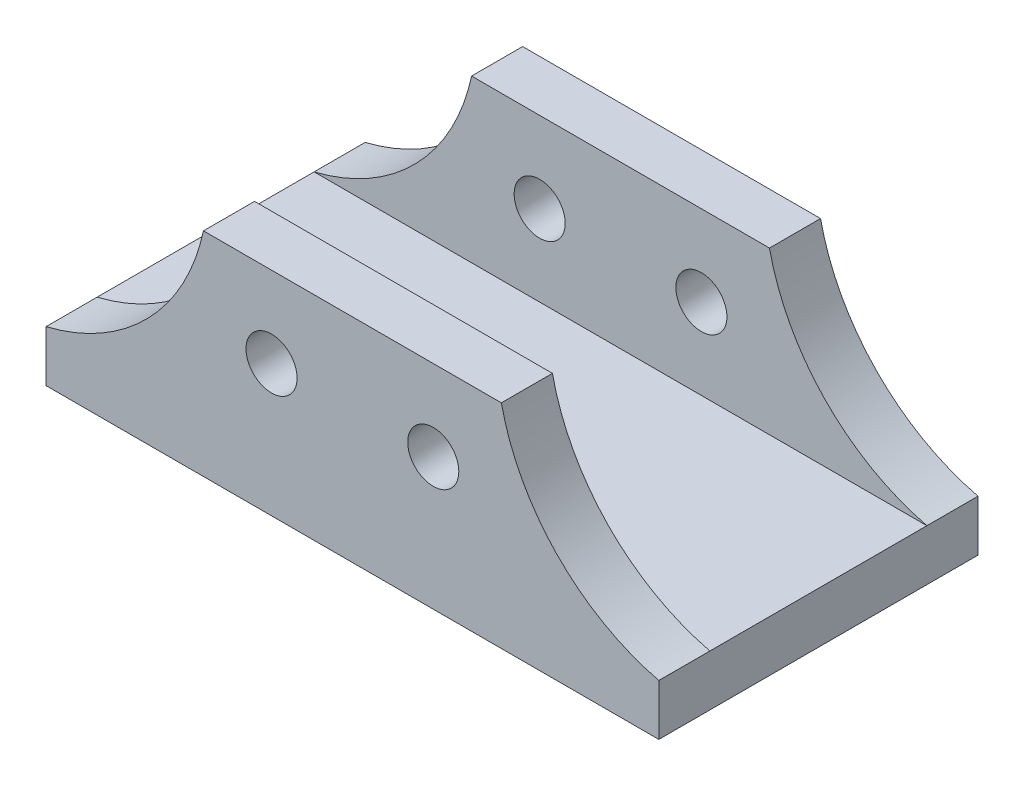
from build123d import *

# Parameters (mm, degrees)
SKETCH1_R           = 6
BOSS_EXTRUDE1_DEPTH = 12
BOSS_EXTRUDE2_START = -25.5
SKETCH2_W           = 144
SKETCH2_H           = 12
BOSS_EXTRUDE2_DEPTH = 51


with BuildPart() as part:
    # Sketch1 → Boss-Extrude1 (new body)
    with BuildSketch(Plane.XY):
        with BuildLine():
            Line((-72, 0), (72, 0))
            Line((72, 0), (72, 12))
            ThreePointArc((72, 12), (48.046284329, 25.689803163), (35, 50))
            Line((35, 50), (-35, 50))
            ThreePointArc((-35, 50), (-48.046284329, 25.689803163), (-72, 12))
            Line((-72, 12), (-72, 0))
        make_face()
        with Locations((19, 31)):
            Circle(SKETCH1_R, mode=Mode.SUBTRACT)
        with Locations(Location((-19, 31, 0), (0, 0, 180))):
            Circle(SKETCH1_R, mode=Mode.SUBTRACT)
    extrude(amount=BOSS_EXTRUDE1_DEPTH)


with BuildPart() as body_2:
    # Mirror1: mirrored copy
    add(part.part.mirror(Plane.XY.offset(37.5)))


with BuildPart() as part_1:
    add(part.part)

    add(body_2.part)  # Boss-Extrude2 merges body 2
    # Sketch2 → Boss-Extrude2 (add)
    with BuildSketch(Plane.XY.offset(37.5).offset(BOSS_EXTRUDE2_START)):
        with Locations((0, 6)):
            Rectangle(SKETCH2_W, SKETCH2_H)
    extrude(amount=BOSS_EXTRUDE2_DEPTH)


solid = part_1.part
